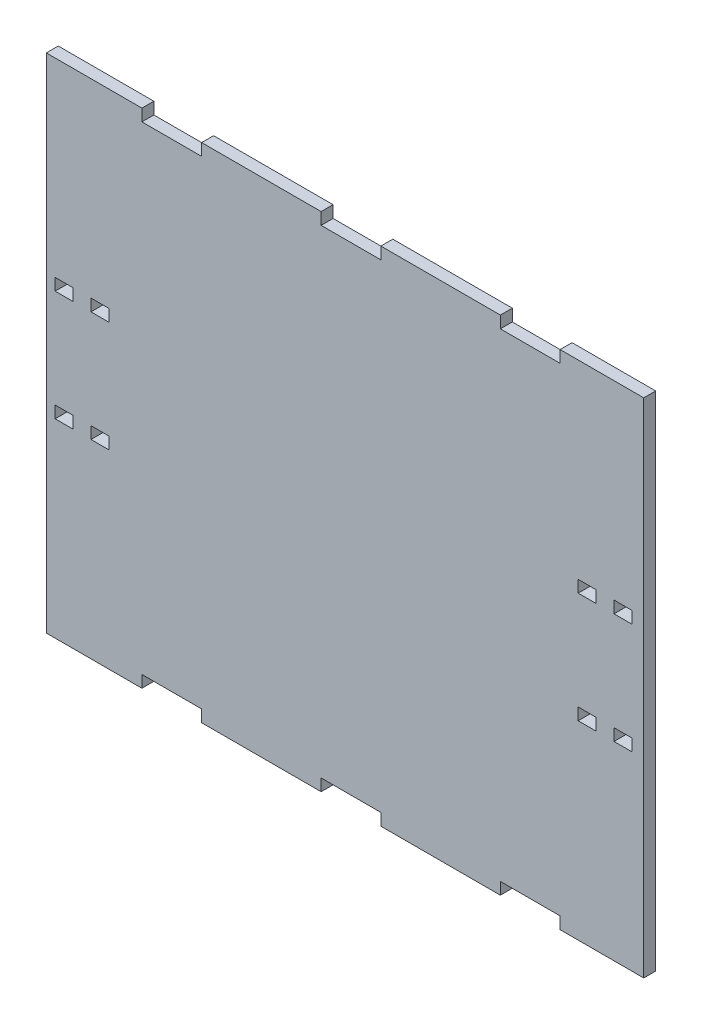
from build123d import *

# Parameters (mm, degrees)
SCHIZZO1_W                   = 1000
SCHIZZO1_H                   = 841
ESTRUSIONE_ESTRUSIONE1_DEPTH = 20
TAGLIO_ESTRUSIONE1_DEPTH     = 1102.964085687
SCHIZZO3_W                   = 100
SCHIZZO3_H                   = 19.99
SCHIZZO3_H_2                 = 20
TAGLIO_ESTRUSIONE2_DEPTH     = 20
RIPETIZIONE_A_L1_COUNT       = 3
RIPETIZIONE_A_L1_PITCH       = 300


with BuildPart() as part:
    # Schizzo1 → Estrusione-Estrusione1 (new body)
    with BuildSketch(Plane.XY):
        Rectangle(SCHIZZO1_W, SCHIZZO1_H)
    extrude(amount=ESTRUSIONE_ESTRUSIONE1_DEPTH)

    # Schizzo3D1 → Taglio-Estrusione1 (cut, through all)
    with BuildSketch(Plane(origin=(480.263874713, -82.498590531, 0), x_dir=(-0.9821318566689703, 0.1881940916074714, 0), z_dir=(0, 0, 1))):
        Polygon((0, 0), (29.463955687, 5.645822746), (25.700073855, 25.288459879), (-3.763881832, 19.642637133), align=None)
        Polygon((58.927911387, 11.291645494), (88.391867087, 16.937468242), (84.627985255, 36.580105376), (55.164029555, 30.934282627), align=None)
        Polygon((890.906058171, 2.705168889), (920.370013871, 8.350991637), (924.133895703, -11.291645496), (894.669940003, -16.937468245), align=None)
        Polygon((89.981145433, -150.766419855), (119.445101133, -145.120597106), (123.208982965, -164.76323424), (93.745027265, -170.409056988), align=None)
        Polygon((60.517189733, -156.412242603), (31.053234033, -162.058065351), (34.817115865, -181.700702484), (64.281071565, -176.054879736), align=None)
        Polygon((944.480809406, 201.343339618), (915.016853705, 195.69751687), (918.780735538, 176.054879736), (948.244691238, 181.700702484), align=None)
        Polygon((859.852824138, 164.76323424), (889.316779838, 170.409056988), (885.552898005, 190.051694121), (856.088942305, 184.405871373), align=None)
        Polygon((953.597851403, -5.645822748), (983.061807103, 0), (979.297925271, 19.642637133), (949.833969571, 13.996814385), align=None)
    extrude(amount=TAGLIO_ESTRUSIONE1_DEPTH, mode=Mode.SUBTRACT)

    # Schizzo3 → Taglio-Estrusione2 (cut)
    with BuildSketch(Plane(origin=(0, 0, 0), x_dir=(-1, 0, 0), z_dir=(0, 0, -1))):
        with Locations((290, 410.505)):
            Rectangle(SCHIZZO3_W, SCHIZZO3_H)
        with Locations((290, -410.5)):
            Rectangle(SCHIZZO3_W, SCHIZZO3_H_2)
    taglio_estrusione2 = extrude(amount=-TAGLIO_ESTRUSIONE2_DEPTH, mode=Mode.SUBTRACT)

    # Ripetizione a L1: Taglio-Estrusione2 ×3
    with Locations(*[(i * RIPETIZIONE_A_L1_PITCH, 0, 0) for i in range(1, RIPETIZIONE_A_L1_COUNT)]):
        add(taglio_estrusione2, mode=Mode.SUBTRACT)


solid = part.part
